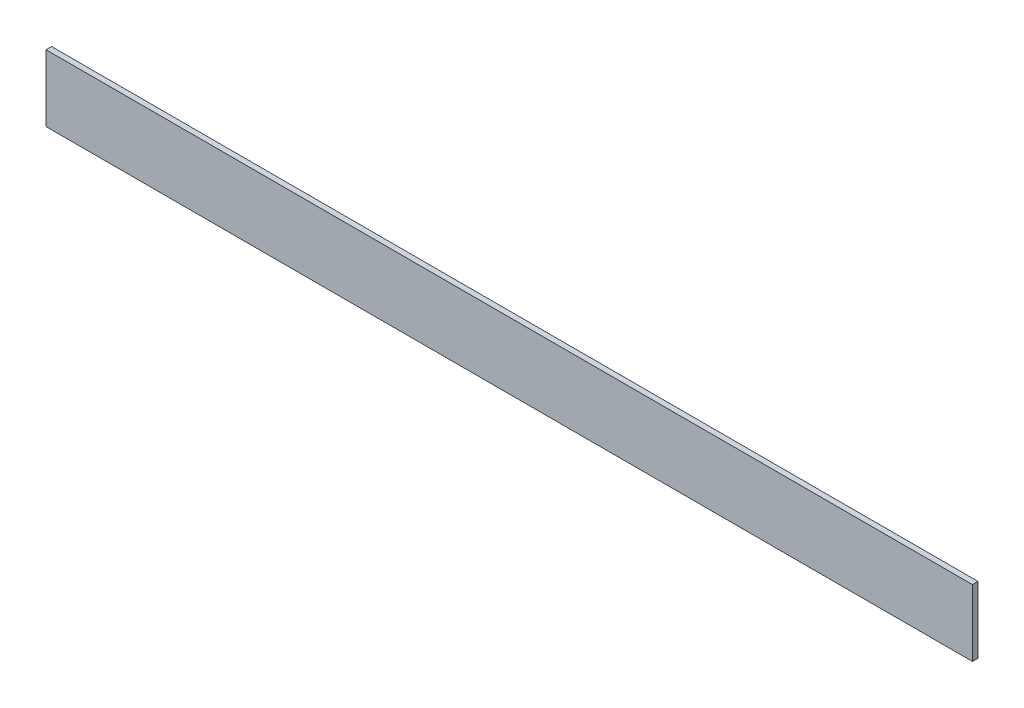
from build123d import *

# Parameters (mm, degrees)
SKETCH1_W           = 1060.45
SKETCH1_H           = 76.2
BOSS_EXTRUDE1_DEPTH = 6.35


with BuildPart() as part:
    # Sketch1 → Boss-Extrude1 (new body)
    with BuildSketch(Plane.XY):
        Rectangle(SKETCH1_W, SKETCH1_H)
    extrude(amount=BOSS_EXTRUDE1_DEPTH)


solid = part.part
